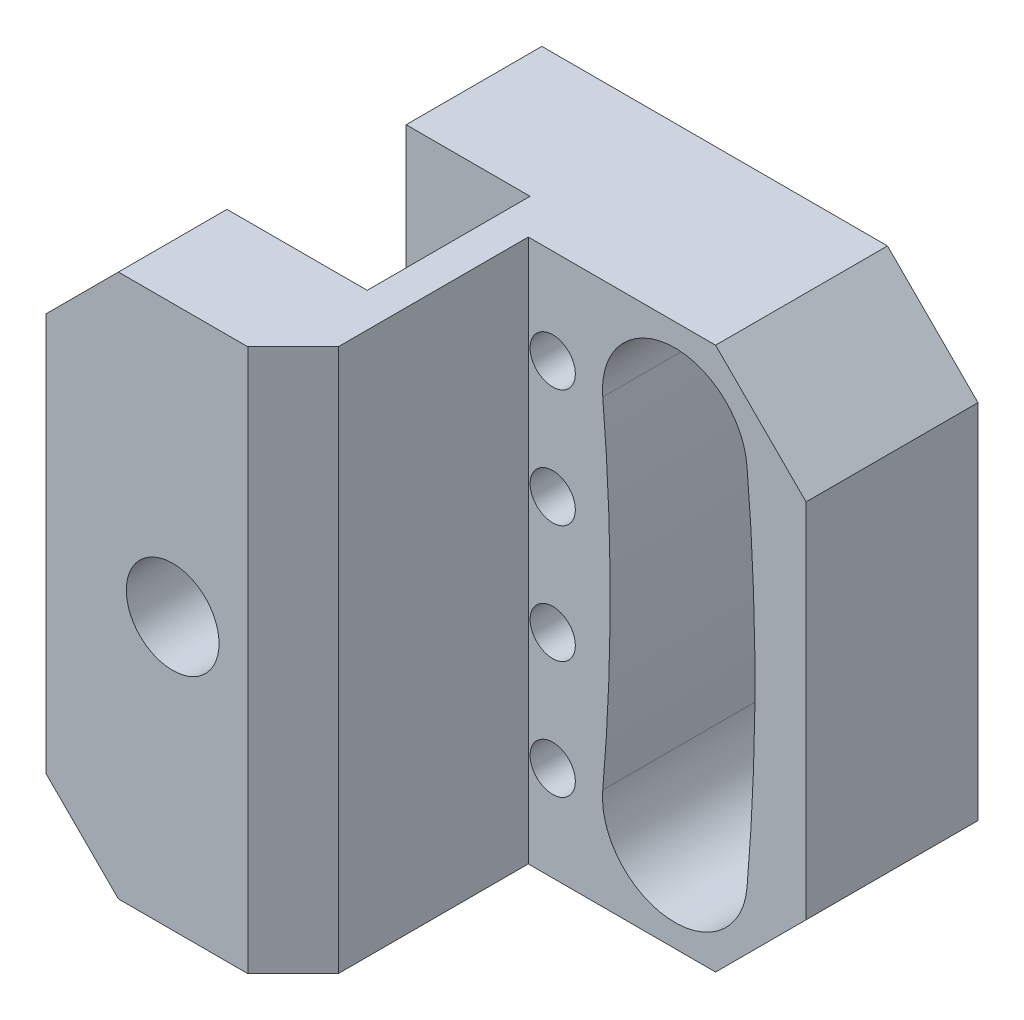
from build123d import *

# Parameters (mm, degrees)
BASE_EXTRUSION_DEPTH                   = 45
ESQUISSE2_W                            = 30.7
ESQUISSE2_H                            = 19.8
ENL_V_MAT_EXTRU_1_DEPTH                = 97.046863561
ENL_V_MAT_EXTRU_2_REACH                = 98.047
ESQUISSE3_R                            = 10.25
ENL_V_MAT_EXTRU_3_REACH                = 98.047
CHANFREIN1_SIZE                        = 2
D_GAGEMENT_M61_D                       = 5
D_GAGEMENT_M61_DEPTH                   = 37
D_GAGEMENT_M61_TIP                     = 1.502151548
ENL_V_MAT_EXTRU_7_DEPTH                = 97.046863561
ENL_V_MAT_EXTRU_8_REACH                = 98.047
ESQUISSE16_W                           = 30.7
ESQUISSE16_H                           = 60
CHANFREIN2_SIZE                        = 5
ENL_V_MAT_EXTRU_11_DEPTH               = 5
ENL_V_MAT_EXTRU_12_DEPTH               = 5
DIAM_TRE_DU_PER_AGE_4_2_4_2_1_D        = 4.2
DIAM_TRE_DU_PER_AGE_4_2_4_2_1_DEPTH    = 14
DIAM_TRE_DU_PER_AGE_4_2_4_2_1_TIP      = 1.212435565
ESQUISSE26_W                           = 11.8
ESQUISSE26_H                           = 15
ENL_V_MAT_EXTRU_13_DEPTH               = 97.046863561
ESQUISSE27_W                           = 25.5
ESQUISSE27_H                           = 18
ENL_V_MAT_EXTRU_14_DEPTH               = 97.046863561
DIAM_TRE_DU_PER_AGE_10_2_10_25_1_D     = 10.25
DIAM_TRE_DU_PER_AGE_10_2_10_25_1_DEPTH = 12
CHANFREIN3_SIZE                        = 10


with BuildPart() as part:
    # Esquisse1 → Base-Extrusion (new body)
    with BuildSketch(Plane.XY):
        Polygon((10, 0), (60, 0), (60, 50), (50, 60), (10, 60), (0, 50), (0, 10), align=None)
    extrude(amount=BASE_EXTRUSION_DEPTH)

    # Esquisse2 → Enl_v. mat.-Extru.1 (cut, through all)
    with BuildSketch(Plane.XZ):
        with Locations((44.65, 28.9)):
            Rectangle(ESQUISSE2_W, ESQUISSE2_H)
    extrude(amount=-ENL_V_MAT_EXTRU_1_DEPTH, mode=Mode.SUBTRACT)

    # Esquisse3 → Enl_v. mat.-Extru.2 (cut, up to next)
    with BuildSketch(Plane.XY.offset(45), mode=Mode.PRIVATE) as enl_v_mat_extru_2_sk1:
        with Locations((45.6, 30)):
            Circle(ESQUISSE3_R)
    enl_v_mat_extru_2_tool1 = extrude(enl_v_mat_extru_2_sk1.sketch, amount=-ENL_V_MAT_EXTRU_2_REACH, mode=Mode.PRIVATE) & part.part
    add(enl_v_mat_extru_2_tool1.solids().sort_by_distance((45.6, 30, 45))[0], mode=Mode.SUBTRACT)

    # Esquisse4 → Enl_v. mat.-Extru.3 (cut, up to next)
    with BuildSketch(Plane(origin=(0, 0, 0), x_dir=(-1, 0, 0), z_dir=(0, 0, -1)), mode=Mode.PRIVATE) as enl_v_mat_extru_3_sk1:
        with BuildLine():
            ThreePointArc((-37.530101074, 48.806666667), (-44.806666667, 57.469898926), (-53.469898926, 50.193333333))
            ThreePointArc((-53.469898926, 50.193333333), (-54.346592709, 30), (-53.469898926, 9.806666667))
            ThreePointArc((-53.469898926, 9.806666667), (-44.806666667, 2.530101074), (-37.530101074, 11.193333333))
            ThreePointArc((-37.530101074, 11.193333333), (-38.346592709, 30), (-37.530101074, 48.806666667))
        make_face()
    enl_v_mat_extru_3_tool1 = extrude(enl_v_mat_extru_3_sk1.sketch, amount=-ENL_V_MAT_EXTRU_3_REACH, mode=Mode.PRIVATE) & part.part
    add(enl_v_mat_extru_3_tool1.solids().sort_by_distance((45.926933, 30, 0))[0], mode=Mode.SUBTRACT)

    # Chanfrein1
    chanfrein1_edges = [part.edges().sort_by_distance(p)[0] for p in [
        (0, 30, 45),
    ]]
    chamfer(chanfrein1_edges, length=CHANFREIN1_SIZE)

    # D_gagement M61
    with Locations(Plane.XY.offset(45)):
        with Locations((32, 49.5), (32, 36.5), (32, 23.5), (32, 10.5)):
            Hole(D_GAGEMENT_M61_D / 2, depth=D_GAGEMENT_M61_DEPTH)
            with Locations((0, 0, -(D_GAGEMENT_M61_DEPTH + D_GAGEMENT_M61_TIP / 2))):  # 118° drill point
                Cone(0, D_GAGEMENT_M61_D / 2, D_GAGEMENT_M61_TIP, mode=Mode.SUBTRACT)

    # Esquisse15 → Enl_v. mat.-Extru.7 (cut, through all)
    with BuildSketch(Plane.XY.offset(45)):
        Polygon((0, 32), (2, 30), (0, 28), align=None)
    extrude(amount=-ENL_V_MAT_EXTRU_7_DEPTH, mode=Mode.SUBTRACT)

    # Esquisse16 → Enl_v. mat.-Extru.8 (cut, up to next)
    with BuildSketch(Plane.XY.offset(45), mode=Mode.PRIVATE) as enl_v_mat_extru_8_sk1:
        with Locations((44.65, 30)):
            Rectangle(ESQUISSE16_W, ESQUISSE16_H)
    enl_v_mat_extru_8_tool1 = extrude(enl_v_mat_extru_8_sk1.sketch, amount=-ENL_V_MAT_EXTRU_8_REACH, mode=Mode.PRIVATE) & part.part
    add(enl_v_mat_extru_8_tool1.solids().sort_by_distance((44.65, 30, 45))[0], mode=Mode.SUBTRACT)

    # Chanfrein2
    chanfrein2_edges = [part.edges().sort_by_distance(p)[0] for p in [
        (29.3, 30, 45),
    ]]
    chamfer(chanfrein2_edges, length=CHANFREIN2_SIZE)

    # Esquisse17 → Enl_v. mat.-Extru.11 (cut)
    with BuildSketch(Plane(origin=(0, 0, 0), x_dir=(-1, 0, 0), z_dir=(0, 0, -1))):
        with BuildLine():
            ThreePointArc((-35.793580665, 56.322429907), (-36.6, 30), (-35.793580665, 3.677570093))
            ThreePointArc((-35.793580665, 3.677570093), (-33.674901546, 1.803750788), (-31.80108224, 3.922429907))
            ThreePointArc((-31.80108224, 3.922429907), (-32.6, 30), (-31.80108224, 56.077570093))
            ThreePointArc((-31.80108224, 56.077570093), (-33.674901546, 58.196249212), (-35.793580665, 56.322429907))
        make_face()
    extrude(amount=-ENL_V_MAT_EXTRU_11_DEPTH, mode=Mode.SUBTRACT)

    # Esquisse18 → Enl_v. mat.-Extru.12 (cut)
    with BuildSketch(Plane(origin=(0, 0, 0), x_dir=(-1, 0, 0), z_dir=(0, 0, -1))):
        with BuildLine():
            ThreePointArc((-29.12858902, 56.365299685), (-30.22, 30), (-29.12858902, 3.634700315))
            ThreePointArc((-29.12858902, 3.634700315), (-26.970132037, 1.806842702), (-25.142274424, 3.965299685))
            ThreePointArc((-25.142274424, 3.965299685), (-26.22, 30), (-25.142274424, 56.034700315))
            ThreePointArc((-25.142274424, 56.034700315), (-26.970132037, 58.193157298), (-29.12858902, 56.365299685))
        make_face()
        with BuildLine():
            ThreePointArc((-18.680495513, 55.992885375), (-20.03, 30), (-18.680495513, 4.007114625))
            ThreePointArc((-18.680495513, 4.007114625), (-20.462627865, 1.810753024), (-22.658989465, 3.592885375))
            ThreePointArc((-22.658989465, 3.592885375), (-24.03, 30), (-22.658989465, 56.407114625))
            ThreePointArc((-22.658989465, 56.407114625), (-20.462627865, 58.189246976), (-18.680495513, 55.992885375))
        make_face()
        with BuildLine():
            ThreePointArc((-16.342227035, 56.465989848), (-18.11, 30), (-16.342227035, 3.534010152))
            ThreePointArc((-16.342227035, 3.534010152), (-14.09400375, 1.817766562), (-12.37776016, 4.065989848))
            ThreePointArc((-12.37776016, 4.065989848), (-14.11, 30), (-12.37776016, 55.934010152))
            ThreePointArc((-12.37776016, 55.934010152), (-14.09400375, 58.182233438), (-16.342227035, 56.465989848))
        make_face()
    extrude(amount=-ENL_V_MAT_EXTRU_12_DEPTH, mode=Mode.SUBTRACT)

    # Diam_tre du per_age _4.2 _4.2_1
    with Locations(Plane(origin=(4.266773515, 0, -4.465580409), x_dir=(-1, 0, 0), z_dir=(0, -1, 0))):
        with Locations((-11.733226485, -42.965580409)):
            Hole(DIAM_TRE_DU_PER_AGE_4_2_4_2_1_D / 2, depth=DIAM_TRE_DU_PER_AGE_4_2_4_2_1_DEPTH)
            with Locations((0, 0, -(DIAM_TRE_DU_PER_AGE_4_2_4_2_1_DEPTH + DIAM_TRE_DU_PER_AGE_4_2_4_2_1_TIP / 2))):  # 120° drill point
                Cone(0, DIAM_TRE_DU_PER_AGE_4_2_4_2_1_D / 2, DIAM_TRE_DU_PER_AGE_4_2_4_2_1_TIP, mode=Mode.SUBTRACT)

    # Esquisse26 → Enl_v. mat.-Extru.13 (cut, through all)
    with BuildSketch(Plane.XZ):
        with Locations((5.9, 7.5)):
            Rectangle(ESQUISSE26_W, ESQUISSE26_H)
    extrude(amount=-ENL_V_MAT_EXTRU_13_DEPTH, mode=Mode.SUBTRACT)

    # Esquisse27 → Enl_v. mat.-Extru.14 (cut, through all)
    with BuildSketch(Plane.XZ):
        with Locations((12.75, 24)):
            Rectangle(ESQUISSE27_W, ESQUISSE27_H)
    extrude(amount=-ENL_V_MAT_EXTRU_14_DEPTH, mode=Mode.SUBTRACT)

    # Diam_tre du per_age _10.2 _10.25_1
    with Locations(Plane.XY.offset(45)):
        with Locations((16, 30)):
            Hole(DIAM_TRE_DU_PER_AGE_10_2_10_25_1_D / 2, depth=DIAM_TRE_DU_PER_AGE_10_2_10_25_1_DEPTH)

    # Chanfrein3
    chanfrein3_edges = [part.edges().sort_by_distance(p)[0] for p in [
        (60, 0, 9.5),
    ]]
    chamfer(chanfrein3_edges, length=CHANFREIN3_SIZE)


solid = part.part
